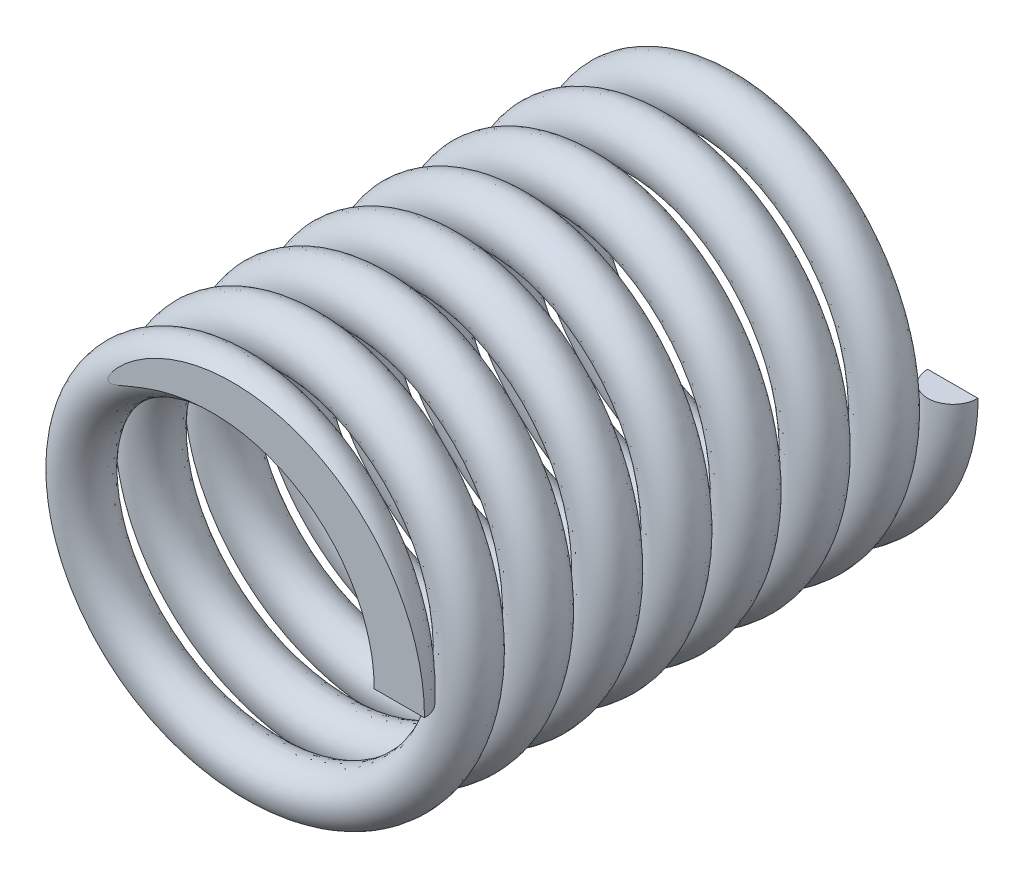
from build123d import *

# Parameters (mm, degrees)
BASE_BALAYAGE_PITCH     = 1.375
BASE_BALAYAGE_HEIGHT    = 11
BASE_BALAYAGE_RADIUS    = 3.5
ESQUISSE2_R             = 0.5
ESQUISSE3_R             = 5.64765097
ENL_V_MAT_EXTRU_1_DEPTH = 13.816005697
ESQUISSE4_R             = 5.597288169
ENL_V_MAT_EXTRU_2_DEPTH = 13.816005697


with BuildPart() as part:
    # Base-Balayage: sweep along a helix
    with BuildLine() as base_balayage_path:
        Helix(BASE_BALAYAGE_PITCH, BASE_BALAYAGE_HEIGHT, BASE_BALAYAGE_RADIUS, center=(0, 0, 0), direction=(0, 0, 1), lefthand=True)
    # Esquisse2 → Base-Balayage (sweep)
    with BuildSketch(Plane(origin=(0, 0, 0), x_dir=(1, 0, 0), z_dir=(0, 1, 0))):
        with Locations((3.5, 0)):
            Circle(ESQUISSE2_R)
    sweep(path=base_balayage_path.line, is_frenet=True)

    # Esquisse3 → Enl_v. mat.-Extru.1 (cut, through all)
    with BuildSketch(Plane.XY):
        Circle(ESQUISSE3_R)
    extrude(amount=-ENL_V_MAT_EXTRU_1_DEPTH, mode=Mode.SUBTRACT)

    # Esquisse4 → Enl_v. mat.-Extru.2 (cut, through all)
    with BuildSketch(Plane.XY.offset(11)):
        Circle(ESQUISSE4_R)
    extrude(amount=ENL_V_MAT_EXTRU_2_DEPTH, mode=Mode.SUBTRACT)


solid = part.part
